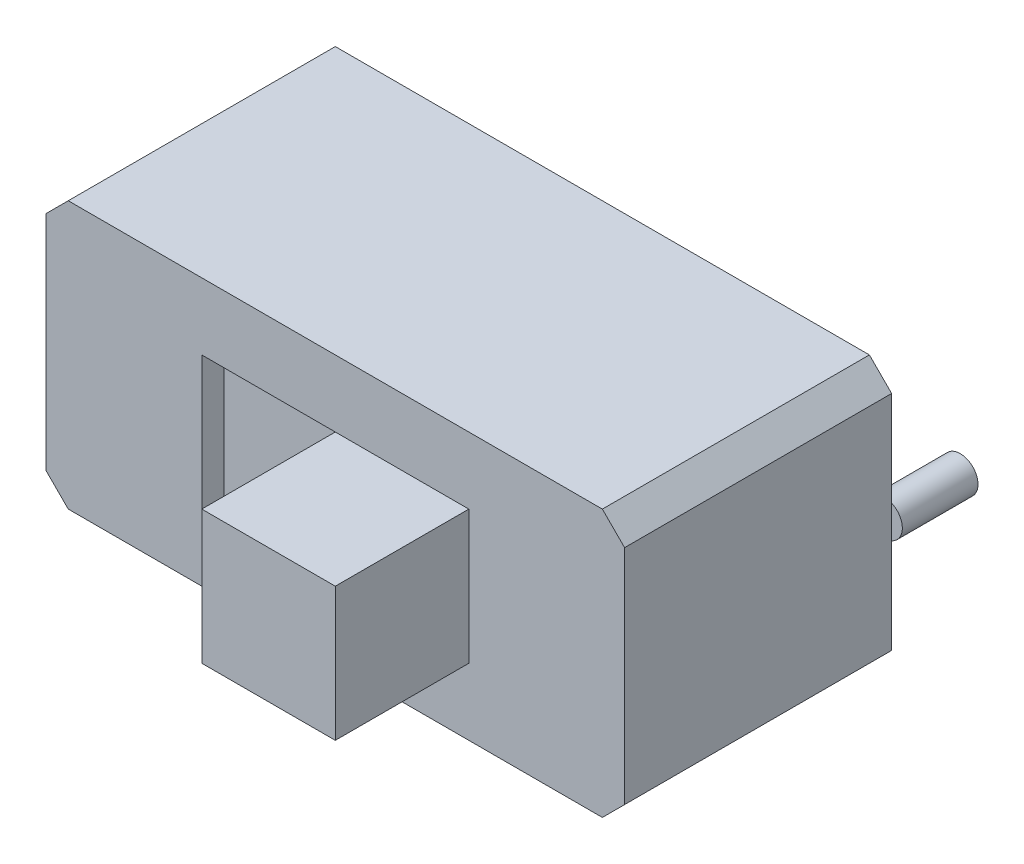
ISO-10303-21;
HEADER;
FILE_DESCRIPTION(('STEP AP214'),'2;1');
FILE_NAME('part.step','',(''),(''),'','','');
FILE_SCHEMA(('AUTOMOTIVE_DESIGN { 1 0 10303 214 1 1 1 1 }'));
ENDSEC;
DATA;
#1=APPLICATION_CONTEXT('core data for automotive mechanical design processes');
#2=APPLICATION_PROTOCOL_DEFINITION('international standard','automotive_design',2000,#1);
#3=PRODUCT_CONTEXT('',#1,'mechanical');
#4=PRODUCT('Part','Part','',(#3));
#5=PRODUCT_RELATED_PRODUCT_CATEGORY('part','',(#4));
#6=PRODUCT_DEFINITION_FORMATION('','',#4);
#7=PRODUCT_DEFINITION_CONTEXT('part definition',#1,'design');
#8=PRODUCT_DEFINITION('design','',#6,#7);
#9=PRODUCT_DEFINITION_SHAPE('','',#8);
#10=(LENGTH_UNIT() NAMED_UNIT(*) SI_UNIT(.MILLI.,.METRE.));
#11=(NAMED_UNIT(*) PLANE_ANGLE_UNIT() SI_UNIT($,.RADIAN.));
#12=(NAMED_UNIT(*) SI_UNIT($,.STERADIAN.) SOLID_ANGLE_UNIT());
#13=UNCERTAINTY_MEASURE_WITH_UNIT(LENGTH_MEASURE(1.E-05),#10,'distance_accuracy_value','');
#14=(GEOMETRIC_REPRESENTATION_CONTEXT(3) GLOBAL_UNCERTAINTY_ASSIGNED_CONTEXT((#13)) GLOBAL_UNIT_ASSIGNED_CONTEXT((#10,
#11,#12)) REPRESENTATION_CONTEXT('',''));
#15=CARTESIAN_POINT('',(0.,0.,0.));
#16=DIRECTION('',(0.,0.,1.));
#17=DIRECTION('',(1.,0.,0.));
#18=AXIS2_PLACEMENT_3D('',#15,#16,#17);
#19=CARTESIAN_POINT('',(0.,9.00000000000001,0.));
#20=DIRECTION('',(0.,0.,-1.));
#21=DIRECTION('',(-1.,0.,0.));
#22=AXIS2_PLACEMENT_3D('',#19,#20,#21);
#23=PLANE('',#22);
#24=CARTESIAN_POINT('',(3.17,0.,0.));
#25=DIRECTION('',(0.,0.,-1.));
#26=DIRECTION('',(1.,0.,0.));
#27=AXIS2_PLACEMENT_3D('',#24,#25,#26);
#28=CIRCLE('',#27,0.4);
#29=CARTESIAN_POINT('',(3.57,0.,0.));
#30=VERTEX_POINT('',#29);
#31=EDGE_CURVE('E270',#30,#30,#28,.T.);
#32=ORIENTED_EDGE('',*,*,#31,.F.);
#33=EDGE_LOOP('',(#32));
#34=FACE_BOUND('',#33,.T.);
#35=CARTESIAN_POINT('',(0.,0.,0.));
#36=DIRECTION('',(0.,0.,-1.));
#37=DIRECTION('',(-1.,0.,0.));
#38=AXIS2_PLACEMENT_3D('',#35,#36,#37);
#39=CIRCLE('',#38,0.4);
#40=CARTESIAN_POINT('',(-0.4,0.,0.));
#41=VERTEX_POINT('',#40);
#42=EDGE_CURVE('E264',#41,#41,#39,.T.);
#43=ORIENTED_EDGE('',*,*,#42,.F.);
#44=EDGE_LOOP('',(#43));
#45=FACE_BOUND('',#44,.T.);
#46=CARTESIAN_POINT('',(-3.17,0.,0.));
#47=DIRECTION('',(0.,0.,-1.));
#48=DIRECTION('',(-1.,0.,0.));
#49=AXIS2_PLACEMENT_3D('',#46,#47,#48);
#50=CIRCLE('',#49,0.4);
#51=CARTESIAN_POINT('',(-3.57,0.,0.));
#52=VERTEX_POINT('',#51);
#53=EDGE_CURVE('E276',#52,#52,#50,.T.);
#54=ORIENTED_EDGE('',*,*,#53,.F.);
#55=EDGE_LOOP('',(#54));
#56=FACE_BOUND('',#55,.T.);
#57=DIRECTION('',(0.,1.,0.));
#58=VECTOR('',#57,1.);
#59=CARTESIAN_POINT('',(6.5,-2.5,0.));
#60=LINE('',#59,#58);
#61=CARTESIAN_POINT('',(6.5,0.366606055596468,0.));
#62=VERTEX_POINT('',#61);
#63=CARTESIAN_POINT('',(6.5,2.5,0.));
#64=VERTEX_POINT('',#63);
#65=EDGE_CURVE('E163',#62,#64,#60,.T.);
#66=ORIENTED_EDGE('',*,*,#65,.F.);
#67=CARTESIAN_POINT('',(6.34,0.,0.));
#68=DIRECTION('',(0.,0.,-1.));
#69=DIRECTION('',(1.,0.,0.));
#70=AXIS2_PLACEMENT_3D('',#67,#68,#69);
#71=CIRCLE('',#70,0.4);
#72=CARTESIAN_POINT('',(6.5,-0.366606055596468,0.));
#73=VERTEX_POINT('',#72);
#74=EDGE_CURVE('E50',#73,#62,#71,.T.);
#75=ORIENTED_EDGE('',*,*,#74,.F.);
#76=CARTESIAN_POINT('',(6.5,-2.5,0.));
#77=VERTEX_POINT('',#76);
#78=EDGE_CURVE('E162',#77,#73,#60,.T.);
#79=ORIENTED_EDGE('',*,*,#78,.F.);
#80=DIRECTION('',(0.707106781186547,0.707106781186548,0.));
#81=VECTOR('',#80,1.);
#82=CARTESIAN_POINT('',(6.5,-2.5,0.));
#83=LINE('',#82,#81);
#84=CARTESIAN_POINT('',(6.,-3.,0.));
#85=VERTEX_POINT('',#84);
#86=EDGE_CURVE('E182',#85,#77,#83,.T.);
#87=ORIENTED_EDGE('',*,*,#86,.F.);
#88=DIRECTION('',(1.,0.,0.));
#89=VECTOR('',#88,1.);
#90=CARTESIAN_POINT('',(6.,-3.,0.));
#91=LINE('',#90,#89);
#92=CARTESIAN_POINT('',(-6.,-3.,0.));
#93=VERTEX_POINT('',#92);
#94=EDGE_CURVE('E185',#93,#85,#91,.T.);
#95=ORIENTED_EDGE('',*,*,#94,.F.);
#96=DIRECTION('',(0.707106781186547,-0.707106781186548,0.));
#97=VECTOR('',#96,1.);
#98=CARTESIAN_POINT('',(-6.5,-2.5,0.));
#99=LINE('',#98,#97);
#100=CARTESIAN_POINT('',(-6.5,-2.5,0.));
#101=VERTEX_POINT('',#100);
#102=EDGE_CURVE('E188',#101,#93,#99,.T.);
#103=ORIENTED_EDGE('',*,*,#102,.F.);
#104=DIRECTION('',(0.,-1.,0.));
#105=VECTOR('',#104,1.);
#106=CARTESIAN_POINT('',(-6.5,-2.5,0.));
#107=LINE('',#106,#105);
#108=CARTESIAN_POINT('',(-6.5,-0.366606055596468,0.));
#109=VERTEX_POINT('',#108);
#110=EDGE_CURVE('E196',#109,#101,#107,.T.);
#111=ORIENTED_EDGE('',*,*,#110,.F.);
#112=CARTESIAN_POINT('',(-6.34,0.,0.));
#113=DIRECTION('',(0.,0.,-1.));
#114=DIRECTION('',(-1.,0.,0.));
#115=AXIS2_PLACEMENT_3D('',#112,#113,#114);
#116=CIRCLE('',#115,0.4);
#117=CARTESIAN_POINT('',(-6.5,0.366606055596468,0.));
#118=VERTEX_POINT('',#117);
#119=EDGE_CURVE('E57',#118,#109,#116,.T.);
#120=ORIENTED_EDGE('',*,*,#119,.F.);
#121=CARTESIAN_POINT('',(-6.5,2.5,0.));
#122=VERTEX_POINT('',#121);
#123=EDGE_CURVE('E192',#122,#118,#107,.T.);
#124=ORIENTED_EDGE('',*,*,#123,.F.);
#125=DIRECTION('',(-0.707106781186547,-0.707106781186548,0.));
#126=VECTOR('',#125,1.);
#127=CARTESIAN_POINT('',(-6.5,2.5,0.));
#128=LINE('',#127,#126);
#129=CARTESIAN_POINT('',(-6.,3.,0.));
#130=VERTEX_POINT('',#129);
#131=EDGE_CURVE('E197',#130,#122,#128,.T.);
#132=ORIENTED_EDGE('',*,*,#131,.F.);
#133=DIRECTION('',(-1.,0.,0.));
#134=VECTOR('',#133,1.);
#135=CARTESIAN_POINT('',(6.,3.,0.));
#136=LINE('',#135,#134);
#137=CARTESIAN_POINT('',(6.,3.,0.));
#138=VERTEX_POINT('',#137);
#139=EDGE_CURVE('E199',#138,#130,#136,.T.);
#140=ORIENTED_EDGE('',*,*,#139,.F.);
#141=DIRECTION('',(-0.707106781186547,0.707106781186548,0.));
#142=VECTOR('',#141,1.);
#143=CARTESIAN_POINT('',(6.5,2.5,0.));
#144=LINE('',#143,#142);
#145=EDGE_CURVE('E201',#64,#138,#144,.T.);
#146=ORIENTED_EDGE('',*,*,#145,.F.);
#147=EDGE_LOOP('',(#66,#75,#79,#87,#95,#103,#111,#120,#124,#132,#140,#146));
#148=FACE_BOUND('',#147,.T.);
#149=ADVANCED_FACE('F36',(#34,#45,#56,#148),#23,.T.);
#150=CARTESIAN_POINT('',(0.,9.00000000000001,6.));
#151=DIRECTION('',(0.,0.,-1.));
#152=DIRECTION('',(-1.,0.,0.));
#153=AXIS2_PLACEMENT_3D('',#150,#151,#152);
#154=PLANE('',#153);
#155=DIRECTION('',(-0.707106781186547,0.707106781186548,0.));
#156=VECTOR('',#155,1.);
#157=CARTESIAN_POINT('',(6.5,2.5,6.));
#158=LINE('',#157,#156);
#159=CARTESIAN_POINT('',(6.5,2.5,6.));
#160=VERTEX_POINT('',#159);
#161=CARTESIAN_POINT('',(6.,3.,6.));
#162=VERTEX_POINT('',#161);
#163=EDGE_CURVE('E177',#160,#162,#158,.T.);
#164=ORIENTED_EDGE('',*,*,#163,.T.);
#165=DIRECTION('',(-1.,0.,0.));
#166=VECTOR('',#165,1.);
#167=CARTESIAN_POINT('',(6.,3.,6.));
#168=LINE('',#167,#166);
#169=CARTESIAN_POINT('',(-6.,3.,6.));
#170=VERTEX_POINT('',#169);
#171=EDGE_CURVE('E179',#162,#170,#168,.T.);
#172=ORIENTED_EDGE('',*,*,#171,.T.);
#173=DIRECTION('',(-0.707106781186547,-0.707106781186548,0.));
#174=VECTOR('',#173,1.);
#175=CARTESIAN_POINT('',(-6.5,2.5,6.));
#176=LINE('',#175,#174);
#177=CARTESIAN_POINT('',(-6.5,2.5,6.));
#178=VERTEX_POINT('',#177);
#179=EDGE_CURVE('E329',#170,#178,#176,.T.);
#180=ORIENTED_EDGE('',*,*,#179,.T.);
#181=DIRECTION('',(0.,-1.,0.));
#182=VECTOR('',#181,1.);
#183=CARTESIAN_POINT('',(-6.5,-2.5,6.));
#184=LINE('',#183,#182);
#185=CARTESIAN_POINT('',(-6.5,-2.5,6.));
#186=VERTEX_POINT('',#185);
#187=EDGE_CURVE('E303',#178,#186,#184,.T.);
#188=ORIENTED_EDGE('',*,*,#187,.T.);
#189=DIRECTION('',(0.707106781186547,-0.707106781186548,0.));
#190=VECTOR('',#189,1.);
#191=CARTESIAN_POINT('',(-6.5,-2.5,6.));
#192=LINE('',#191,#190);
#193=CARTESIAN_POINT('',(-6.,-3.,6.));
#194=VERTEX_POINT('',#193);
#195=EDGE_CURVE('E326',#186,#194,#192,.T.);
#196=ORIENTED_EDGE('',*,*,#195,.T.);
#197=DIRECTION('',(1.,0.,0.));
#198=VECTOR('',#197,1.);
#199=CARTESIAN_POINT('',(6.,-3.,6.));
#200=LINE('',#199,#198);
#201=CARTESIAN_POINT('',(6.,-3.,6.));
#202=VERTEX_POINT('',#201);
#203=EDGE_CURVE('E324',#194,#202,#200,.T.);
#204=ORIENTED_EDGE('',*,*,#203,.T.);
#205=DIRECTION('',(0.707106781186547,0.707106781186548,0.));
#206=VECTOR('',#205,1.);
#207=CARTESIAN_POINT('',(6.5,-2.5,6.));
#208=LINE('',#207,#206);
#209=CARTESIAN_POINT('',(6.5,-2.5,6.));
#210=VERTEX_POINT('',#209);
#211=EDGE_CURVE('E322',#202,#210,#208,.T.);
#212=ORIENTED_EDGE('',*,*,#211,.T.);
#213=DIRECTION('',(0.,1.,0.));
#214=VECTOR('',#213,1.);
#215=CARTESIAN_POINT('',(6.5,-2.5,6.));
#216=LINE('',#215,#214);
#217=EDGE_CURVE('E320',#210,#160,#216,.T.);
#218=ORIENTED_EDGE('',*,*,#217,.T.);
#219=EDGE_LOOP('',(#164,#172,#180,#188,#196,#204,#212,#218));
#220=FACE_BOUND('',#219,.T.);
#221=DIRECTION('',(0.,-1.,0.));
#222=VECTOR('',#221,1.);
#223=CARTESIAN_POINT('',(-3.,-1.5,6.));
#224=LINE('',#223,#222);
#225=CARTESIAN_POINT('',(-3.,1.5,6.));
#226=VERTEX_POINT('',#225);
#227=CARTESIAN_POINT('',(-3.,-1.5,6.));
#228=VERTEX_POINT('',#227);
#229=EDGE_CURVE('E257',#226,#228,#224,.T.);
#230=ORIENTED_EDGE('',*,*,#229,.F.);
#231=DIRECTION('',(-1.,0.,0.));
#232=VECTOR('',#231,1.);
#233=CARTESIAN_POINT('',(0.,1.5,6.));
#234=LINE('',#233,#232);
#235=CARTESIAN_POINT('',(0.,1.5,6.));
#236=VERTEX_POINT('',#235);
#237=EDGE_CURVE('E260',#236,#226,#234,.T.);
#238=ORIENTED_EDGE('',*,*,#237,.F.);
#239=DIRECTION('',(-1.,0.,0.));
#240=VECTOR('',#239,1.);
#241=CARTESIAN_POINT('',(0.,1.5,6.));
#242=LINE('',#241,#240);
#243=CARTESIAN_POINT('',(3.,1.5,6.));
#244=VERTEX_POINT('',#243);
#245=EDGE_CURVE('E225',#244,#236,#242,.T.);
#246=ORIENTED_EDGE('',*,*,#245,.F.);
#247=DIRECTION('',(0.,1.,0.));
#248=VECTOR('',#247,1.);
#249=CARTESIAN_POINT('',(3.,1.5,6.));
#250=LINE('',#249,#248);
#251=CARTESIAN_POINT('',(3.,-1.5,6.));
#252=VERTEX_POINT('',#251);
#253=EDGE_CURVE('E228',#252,#244,#250,.T.);
#254=ORIENTED_EDGE('',*,*,#253,.F.);
#255=DIRECTION('',(1.,0.,0.));
#256=VECTOR('',#255,1.);
#257=CARTESIAN_POINT('',(0.,-1.5,6.));
#258=LINE('',#257,#256);
#259=CARTESIAN_POINT('',(0.,-1.5,6.));
#260=VERTEX_POINT('',#259);
#261=EDGE_CURVE('E231',#260,#252,#258,.T.);
#262=ORIENTED_EDGE('',*,*,#261,.F.);
#263=DIRECTION('',(1.,0.,0.));
#264=VECTOR('',#263,1.);
#265=CARTESIAN_POINT('',(0.,-1.5,6.));
#266=LINE('',#265,#264);
#267=EDGE_CURVE('E255',#228,#260,#266,.T.);
#268=ORIENTED_EDGE('',*,*,#267,.F.);
#269=EDGE_LOOP('',(#230,#238,#246,#254,#262,#268));
#270=FACE_BOUND('',#269,.T.);
#271=ADVANCED_FACE('F333',(#220,#270),#154,.F.);
#272=CARTESIAN_POINT('',(6.5,2.5,6.));
#273=DIRECTION('',(-0.707106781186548,-0.707106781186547,0.));
#274=DIRECTION('',(0.707106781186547,-0.707106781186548,0.));
#275=AXIS2_PLACEMENT_3D('',#272,#273,#274);
#276=PLANE('',#275);
#277=ORIENTED_EDGE('',*,*,#145,.T.);
#278=DIRECTION('',(0.,0.,-1.));
#279=VECTOR('',#278,1.);
#280=CARTESIAN_POINT('',(6.,3.,6.));
#281=LINE('',#280,#279);
#282=EDGE_CURVE('E11',#162,#138,#281,.T.);
#283=ORIENTED_EDGE('',*,*,#282,.F.);
#284=ORIENTED_EDGE('',*,*,#163,.F.);
#285=DIRECTION('',(0.,0.,-1.));
#286=VECTOR('',#285,1.);
#287=CARTESIAN_POINT('',(6.5,2.5,6.));
#288=LINE('',#287,#286);
#289=EDGE_CURVE('E318',#160,#64,#288,.T.);
#290=ORIENTED_EDGE('',*,*,#289,.T.);
#291=EDGE_LOOP('',(#277,#283,#284,#290));
#292=FACE_BOUND('',#291,.T.);
#293=ADVANCED_FACE('F38',(#292),#276,.F.);
#294=CARTESIAN_POINT('',(6.,3.,6.));
#295=DIRECTION('',(0.,-1.,0.));
#296=DIRECTION('',(0.,0.,-1.));
#297=AXIS2_PLACEMENT_3D('',#294,#295,#296);
#298=PLANE('',#297);
#299=ORIENTED_EDGE('',*,*,#139,.T.);
#300=DIRECTION('',(0.,0.,-1.));
#301=VECTOR('',#300,1.);
#302=CARTESIAN_POINT('',(-6.,3.,6.));
#303=LINE('',#302,#301);
#304=EDGE_CURVE('E44',#170,#130,#303,.T.);
#305=ORIENTED_EDGE('',*,*,#304,.F.);
#306=ORIENTED_EDGE('',*,*,#171,.F.);
#307=ORIENTED_EDGE('',*,*,#282,.T.);
#308=EDGE_LOOP('',(#299,#305,#306,#307));
#309=FACE_BOUND('',#308,.T.);
#310=ADVANCED_FACE('F338',(#309),#298,.F.);
#311=CARTESIAN_POINT('',(-6.5,2.5,6.));
#312=DIRECTION('',(0.707106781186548,-0.707106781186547,0.));
#313=DIRECTION('',(0.707106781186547,0.707106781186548,0.));
#314=AXIS2_PLACEMENT_3D('',#311,#312,#313);
#315=PLANE('',#314);
#316=ORIENTED_EDGE('',*,*,#131,.T.);
#317=DIRECTION('',(0.,0.,-1.));
#318=VECTOR('',#317,1.);
#319=CARTESIAN_POINT('',(-6.5,2.5,6.));
#320=LINE('',#319,#318);
#321=EDGE_CURVE('E301',#178,#122,#320,.T.);
#322=ORIENTED_EDGE('',*,*,#321,.F.);
#323=ORIENTED_EDGE('',*,*,#179,.F.);
#324=ORIENTED_EDGE('',*,*,#304,.T.);
#325=EDGE_LOOP('',(#316,#322,#323,#324));
#326=FACE_BOUND('',#325,.T.);
#327=ADVANCED_FACE('F339',(#326),#315,.F.);
#328=CARTESIAN_POINT('',(-6.5,-2.5,6.));
#329=DIRECTION('',(1.,0.,0.));
#330=DIRECTION('',(0.,0.,-1.));
#331=AXIS2_PLACEMENT_3D('',#328,#329,#330);
#332=PLANE('',#331);
#333=ORIENTED_EDGE('',*,*,#123,.T.);
#334=EDGE_CURVE('E195',#118,#109,#107,.T.);
#335=ORIENTED_EDGE('',*,*,#334,.T.);
#336=ORIENTED_EDGE('',*,*,#110,.T.);
#337=DIRECTION('',(0.,0.,-1.));
#338=VECTOR('',#337,1.);
#339=CARTESIAN_POINT('',(-6.5,-2.5,6.));
#340=LINE('',#339,#338);
#341=EDGE_CURVE('E306',#186,#101,#340,.T.);
#342=ORIENTED_EDGE('',*,*,#341,.F.);
#343=ORIENTED_EDGE('',*,*,#187,.F.);
#344=ORIENTED_EDGE('',*,*,#321,.T.);
#345=EDGE_LOOP('',(#333,#335,#336,#342,#343,#344));
#346=FACE_BOUND('',#345,.T.);
#347=ADVANCED_FACE('F298',(#346),#332,.F.);
#348=CARTESIAN_POINT('',(-6.5,-2.5,6.));
#349=DIRECTION('',(0.707106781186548,0.707106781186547,0.));
#350=DIRECTION('',(-0.707106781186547,0.707106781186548,0.));
#351=AXIS2_PLACEMENT_3D('',#348,#349,#350);
#352=PLANE('',#351);
#353=ORIENTED_EDGE('',*,*,#102,.T.);
#354=DIRECTION('',(0.,0.,-1.));
#355=VECTOR('',#354,1.);
#356=CARTESIAN_POINT('',(-6.,-3.,6.));
#357=LINE('',#356,#355);
#358=EDGE_CURVE('E310',#194,#93,#357,.T.);
#359=ORIENTED_EDGE('',*,*,#358,.F.);
#360=ORIENTED_EDGE('',*,*,#195,.F.);
#361=ORIENTED_EDGE('',*,*,#341,.T.);
#362=EDGE_LOOP('',(#353,#359,#360,#361));
#363=FACE_BOUND('',#362,.T.);
#364=ADVANCED_FACE('F346',(#363),#352,.F.);
#365=CARTESIAN_POINT('',(6.,-3.,6.));
#366=DIRECTION('',(0.,1.,0.));
#367=DIRECTION('',(0.,0.,1.));
#368=AXIS2_PLACEMENT_3D('',#365,#366,#367);
#369=PLANE('',#368);
#370=ORIENTED_EDGE('',*,*,#94,.T.);
#371=DIRECTION('',(0.,0.,-1.));
#372=VECTOR('',#371,1.);
#373=CARTESIAN_POINT('',(6.,-3.,6.));
#374=LINE('',#373,#372);
#375=EDGE_CURVE('E315',#202,#85,#374,.T.);
#376=ORIENTED_EDGE('',*,*,#375,.F.);
#377=ORIENTED_EDGE('',*,*,#203,.F.);
#378=ORIENTED_EDGE('',*,*,#358,.T.);
#379=EDGE_LOOP('',(#370,#376,#377,#378));
#380=FACE_BOUND('',#379,.T.);
#381=ADVANCED_FACE('F366',(#380),#369,.F.);
#382=CARTESIAN_POINT('',(6.5,-2.5,6.));
#383=DIRECTION('',(-0.707106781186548,0.707106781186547,0.));
#384=DIRECTION('',(-0.707106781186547,-0.707106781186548,0.));
#385=AXIS2_PLACEMENT_3D('',#382,#383,#384);
#386=PLANE('',#385);
#387=ORIENTED_EDGE('',*,*,#86,.T.);
#388=DIRECTION('',(0.,0.,-1.));
#389=VECTOR('',#388,1.);
#390=CARTESIAN_POINT('',(6.5,-2.5,6.));
#391=LINE('',#390,#389);
#392=EDGE_CURVE('E176',#210,#77,#391,.T.);
#393=ORIENTED_EDGE('',*,*,#392,.F.);
#394=ORIENTED_EDGE('',*,*,#211,.F.);
#395=ORIENTED_EDGE('',*,*,#375,.T.);
#396=EDGE_LOOP('',(#387,#393,#394,#395));
#397=FACE_BOUND('',#396,.T.);
#398=ADVANCED_FACE('F363',(#397),#386,.F.);
#399=CARTESIAN_POINT('',(6.5,-2.5,6.));
#400=DIRECTION('',(-1.,0.,0.));
#401=DIRECTION('',(0.,0.,1.));
#402=AXIS2_PLACEMENT_3D('',#399,#400,#401);
#403=PLANE('',#402);
#404=ORIENTED_EDGE('',*,*,#78,.T.);
#405=EDGE_CURVE('E156',#73,#62,#60,.T.);
#406=ORIENTED_EDGE('',*,*,#405,.T.);
#407=ORIENTED_EDGE('',*,*,#65,.T.);
#408=ORIENTED_EDGE('',*,*,#289,.F.);
#409=ORIENTED_EDGE('',*,*,#217,.F.);
#410=ORIENTED_EDGE('',*,*,#392,.T.);
#411=EDGE_LOOP('',(#404,#406,#407,#408,#409,#410));
#412=FACE_BOUND('',#411,.T.);
#413=ADVANCED_FACE('F173',(#412),#403,.F.);
#414=CARTESIAN_POINT('',(0.,-1.5,9.));
#415=DIRECTION('',(1.,0.,0.));
#416=DIRECTION('',(0.,0.,-1.));
#417=AXIS2_PLACEMENT_3D('',#414,#415,#416);
#418=PLANE('',#417);
#419=DIRECTION('',(0.,0.,-1.));
#420=VECTOR('',#419,1.);
#421=CARTESIAN_POINT('',(0.,1.5,9.));
#422=LINE('',#421,#420);
#423=CARTESIAN_POINT('',(0.,1.5,9.));
#424=VERTEX_POINT('',#423);
#425=EDGE_CURVE('E213',#424,#236,#422,.T.);
#426=ORIENTED_EDGE('',*,*,#425,.T.);
#427=DIRECTION('',(0.,0.,1.));
#428=VECTOR('',#427,1.);
#429=CARTESIAN_POINT('',(0.,1.5,5.5));
#430=LINE('',#429,#428);
#431=CARTESIAN_POINT('',(0.,1.5,5.5));
#432=VERTEX_POINT('',#431);
#433=EDGE_CURVE('E234',#432,#236,#430,.T.);
#434=ORIENTED_EDGE('',*,*,#433,.F.);
#435=DIRECTION('',(0.,1.,0.));
#436=VECTOR('',#435,1.);
#437=CARTESIAN_POINT('',(0.,-1.5,5.5));
#438=LINE('',#437,#436);
#439=CARTESIAN_POINT('',(0.,-1.5,5.5));
#440=VERTEX_POINT('',#439);
#441=EDGE_CURVE('E238',#440,#432,#438,.T.);
#442=ORIENTED_EDGE('',*,*,#441,.F.);
#443=DIRECTION('',(0.,0.,1.));
#444=VECTOR('',#443,1.);
#445=CARTESIAN_POINT('',(0.,-1.5,5.5));
#446=LINE('',#445,#444);
#447=EDGE_CURVE('E240',#440,#260,#446,.T.);
#448=ORIENTED_EDGE('',*,*,#447,.T.);
#449=DIRECTION('',(0.,0.,-1.));
#450=VECTOR('',#449,1.);
#451=CARTESIAN_POINT('',(0.,-1.5,9.));
#452=LINE('',#451,#450);
#453=CARTESIAN_POINT('',(0.,-1.5,9.));
#454=VERTEX_POINT('',#453);
#455=EDGE_CURVE('E204',#454,#260,#452,.T.);
#456=ORIENTED_EDGE('',*,*,#455,.F.);
#457=DIRECTION('',(0.,-1.,0.));
#458=VECTOR('',#457,1.);
#459=CARTESIAN_POINT('',(0.,-1.5,9.));
#460=LINE('',#459,#458);
#461=EDGE_CURVE('E222',#424,#454,#460,.T.);
#462=ORIENTED_EDGE('',*,*,#461,.F.);
#463=EDGE_LOOP('',(#426,#434,#442,#448,#456,#462));
#464=FACE_BOUND('',#463,.T.);
#465=ADVANCED_FACE('F358',(#464),#418,.F.);
#466=CARTESIAN_POINT('',(0.,-1.5,9.));
#467=DIRECTION('',(0.,1.,0.));
#468=DIRECTION('',(0.,0.,1.));
#469=AXIS2_PLACEMENT_3D('',#466,#467,#468);
#470=PLANE('',#469);
#471=ORIENTED_EDGE('',*,*,#261,.T.);
#472=DIRECTION('',(0.,0.,-1.));
#473=VECTOR('',#472,1.);
#474=CARTESIAN_POINT('',(3.,-1.5,9.));
#475=LINE('',#474,#473);
#476=CARTESIAN_POINT('',(3.,-1.5,9.));
#477=VERTEX_POINT('',#476);
#478=EDGE_CURVE('E207',#477,#252,#475,.T.);
#479=ORIENTED_EDGE('',*,*,#478,.F.);
#480=DIRECTION('',(1.,0.,0.));
#481=VECTOR('',#480,1.);
#482=CARTESIAN_POINT('',(0.,-1.5,9.));
#483=LINE('',#482,#481);
#484=EDGE_CURVE('E220',#454,#477,#483,.T.);
#485=ORIENTED_EDGE('',*,*,#484,.F.);
#486=ORIENTED_EDGE('',*,*,#455,.T.);
#487=EDGE_LOOP('',(#471,#479,#485,#486));
#488=FACE_BOUND('',#487,.T.);
#489=ADVANCED_FACE('F423',(#488),#470,.F.);
#490=CARTESIAN_POINT('',(3.,1.5,9.));
#491=DIRECTION('',(-1.,0.,0.));
#492=DIRECTION('',(0.,-1.,0.));
#493=AXIS2_PLACEMENT_3D('',#490,#491,#492);
#494=PLANE('',#493);
#495=ORIENTED_EDGE('',*,*,#253,.T.);
#496=DIRECTION('',(0.,0.,-1.));
#497=VECTOR('',#496,1.);
#498=CARTESIAN_POINT('',(3.,1.5,9.));
#499=LINE('',#498,#497);
#500=CARTESIAN_POINT('',(3.,1.5,9.));
#501=VERTEX_POINT('',#500);
#502=EDGE_CURVE('E210',#501,#244,#499,.T.);
#503=ORIENTED_EDGE('',*,*,#502,.F.);
#504=DIRECTION('',(0.,1.,0.));
#505=VECTOR('',#504,1.);
#506=CARTESIAN_POINT('',(3.,1.5,9.));
#507=LINE('',#506,#505);
#508=EDGE_CURVE('E218',#477,#501,#507,.T.);
#509=ORIENTED_EDGE('',*,*,#508,.F.);
#510=ORIENTED_EDGE('',*,*,#478,.T.);
#511=EDGE_LOOP('',(#495,#503,#509,#510));
#512=FACE_BOUND('',#511,.T.);
#513=ADVANCED_FACE('F417',(#512),#494,.F.);
#514=CARTESIAN_POINT('',(0.,1.5,9.));
#515=DIRECTION('',(0.,-1.,0.));
#516=DIRECTION('',(0.,0.,-1.));
#517=AXIS2_PLACEMENT_3D('',#514,#515,#516);
#518=PLANE('',#517);
#519=ORIENTED_EDGE('',*,*,#245,.T.);
#520=ORIENTED_EDGE('',*,*,#425,.F.);
#521=DIRECTION('',(-1.,0.,0.));
#522=VECTOR('',#521,1.);
#523=CARTESIAN_POINT('',(0.,1.5,9.));
#524=LINE('',#523,#522);
#525=EDGE_CURVE('E216',#501,#424,#524,.T.);
#526=ORIENTED_EDGE('',*,*,#525,.F.);
#527=ORIENTED_EDGE('',*,*,#502,.T.);
#528=EDGE_LOOP('',(#519,#520,#526,#527));
#529=FACE_BOUND('',#528,.T.);
#530=ADVANCED_FACE('F422',(#529),#518,.F.);
#531=CARTESIAN_POINT('',(0.,1.5,9.));
#532=DIRECTION('',(0.,0.,-1.));
#533=DIRECTION('',(-1.,0.,0.));
#534=AXIS2_PLACEMENT_3D('',#531,#532,#533);
#535=PLANE('',#534);
#536=ORIENTED_EDGE('',*,*,#461,.T.);
#537=ORIENTED_EDGE('',*,*,#484,.T.);
#538=ORIENTED_EDGE('',*,*,#508,.T.);
#539=ORIENTED_EDGE('',*,*,#525,.T.);
#540=EDGE_LOOP('',(#536,#537,#538,#539));
#541=FACE_BOUND('',#540,.T.);
#542=ADVANCED_FACE('F433',(#541),#535,.F.);
#543=CARTESIAN_POINT('',(0.,1.5,5.5));
#544=DIRECTION('',(0.,1.,0.));
#545=DIRECTION('',(-1.,0.,0.));
#546=AXIS2_PLACEMENT_3D('',#543,#544,#545);
#547=PLANE('',#546);
#548=ORIENTED_EDGE('',*,*,#237,.T.);
#549=DIRECTION('',(0.,0.,1.));
#550=VECTOR('',#549,1.);
#551=CARTESIAN_POINT('',(-3.,1.5,5.5));
#552=LINE('',#551,#550);
#553=CARTESIAN_POINT('',(-3.,1.5,5.5));
#554=VERTEX_POINT('',#553);
#555=EDGE_CURVE('E235',#554,#226,#552,.T.);
#556=ORIENTED_EDGE('',*,*,#555,.F.);
#557=DIRECTION('',(-1.,0.,0.));
#558=VECTOR('',#557,1.);
#559=CARTESIAN_POINT('',(0.,1.5,5.5));
#560=LINE('',#559,#558);
#561=EDGE_CURVE('E252',#432,#554,#560,.T.);
#562=ORIENTED_EDGE('',*,*,#561,.F.);
#563=ORIENTED_EDGE('',*,*,#433,.T.);
#564=EDGE_LOOP('',(#548,#556,#562,#563));
#565=FACE_BOUND('',#564,.T.);
#566=ADVANCED_FACE('F437',(#565),#547,.F.);
#567=CARTESIAN_POINT('',(0.,-1.5,5.5));
#568=DIRECTION('',(0.,-1.,0.));
#569=DIRECTION('',(1.,0.,0.));
#570=AXIS2_PLACEMENT_3D('',#567,#568,#569);
#571=PLANE('',#570);
#572=ORIENTED_EDGE('',*,*,#267,.T.);
#573=ORIENTED_EDGE('',*,*,#447,.F.);
#574=DIRECTION('',(1.,0.,0.));
#575=VECTOR('',#574,1.);
#576=CARTESIAN_POINT('',(0.,-1.5,5.5));
#577=LINE('',#576,#575);
#578=CARTESIAN_POINT('',(-3.,-1.5,5.5));
#579=VERTEX_POINT('',#578);
#580=EDGE_CURVE('E246',#579,#440,#577,.T.);
#581=ORIENTED_EDGE('',*,*,#580,.F.);
#582=DIRECTION('',(0.,0.,1.));
#583=VECTOR('',#582,1.);
#584=CARTESIAN_POINT('',(-3.,-1.5,5.5));
#585=LINE('',#584,#583);
#586=EDGE_CURVE('E237',#579,#228,#585,.T.);
#587=ORIENTED_EDGE('',*,*,#586,.T.);
#588=EDGE_LOOP('',(#572,#573,#581,#587));
#589=FACE_BOUND('',#588,.T.);
#590=ADVANCED_FACE('F474',(#589),#571,.F.);
#591=CARTESIAN_POINT('',(-3.,-1.5,5.5));
#592=DIRECTION('',(-1.,0.,0.));
#593=DIRECTION('',(0.,0.,1.));
#594=AXIS2_PLACEMENT_3D('',#591,#592,#593);
#595=PLANE('',#594);
#596=ORIENTED_EDGE('',*,*,#229,.T.);
#597=ORIENTED_EDGE('',*,*,#586,.F.);
#598=DIRECTION('',(0.,-1.,0.));
#599=VECTOR('',#598,1.);
#600=CARTESIAN_POINT('',(-3.,-1.5,5.5));
#601=LINE('',#600,#599);
#602=EDGE_CURVE('E249',#554,#579,#601,.T.);
#603=ORIENTED_EDGE('',*,*,#602,.F.);
#604=ORIENTED_EDGE('',*,*,#555,.T.);
#605=EDGE_LOOP('',(#596,#597,#603,#604));
#606=FACE_BOUND('',#605,.T.);
#607=ADVANCED_FACE('F484',(#606),#595,.F.);
#608=CARTESIAN_POINT('',(0.,1.5,5.5));
#609=DIRECTION('',(0.,0.,-1.));
#610=DIRECTION('',(-1.,0.,0.));
#611=AXIS2_PLACEMENT_3D('',#608,#609,#610);
#612=PLANE('',#611);
#613=ORIENTED_EDGE('',*,*,#561,.T.);
#614=ORIENTED_EDGE('',*,*,#602,.T.);
#615=ORIENTED_EDGE('',*,*,#580,.T.);
#616=ORIENTED_EDGE('',*,*,#441,.T.);
#617=EDGE_LOOP('',(#613,#614,#615,#616));
#618=FACE_BOUND('',#617,.T.);
#619=ADVANCED_FACE('F494',(#618),#612,.F.);
#620=CARTESIAN_POINT('',(0.,0.,-1.7));
#621=DIRECTION('',(0.,0.,1.));
#622=DIRECTION('',(1.,0.,0.));
#623=AXIS2_PLACEMENT_3D('',#620,#621,#622);
#624=CYLINDRICAL_SURFACE('',#623,0.4);
#625=CARTESIAN_POINT('',(0.,0.,-1.7));
#626=DIRECTION('',(0.,0.,-1.));
#627=DIRECTION('',(-1.,0.,0.));
#628=AXIS2_PLACEMENT_3D('',#625,#626,#627);
#629=CIRCLE('',#628,0.4);
#630=CARTESIAN_POINT('',(-0.4,0.,-1.7));
#631=VERTEX_POINT('',#630);
#632=EDGE_CURVE('E263',#631,#631,#629,.T.);
#633=ORIENTED_EDGE('',*,*,#632,.F.);
#634=EDGE_LOOP('',(#633));
#635=FACE_BOUND('',#634,.T.);
#636=ORIENTED_EDGE('',*,*,#42,.T.);
#637=EDGE_LOOP('',(#636));
#638=FACE_BOUND('',#637,.T.);
#639=ADVANCED_FACE('F504',(#635,#638),#624,.T.);
#640=CARTESIAN_POINT('',(0.,0.,-1.7));
#641=DIRECTION('',(0.,0.,-1.));
#642=DIRECTION('',(-1.,0.,0.));
#643=AXIS2_PLACEMENT_3D('',#640,#641,#642);
#644=PLANE('',#643);
#645=ORIENTED_EDGE('',*,*,#632,.T.);
#646=EDGE_LOOP('',(#645));
#647=FACE_BOUND('',#646,.T.);
#648=ADVANCED_FACE('F529',(#647),#644,.T.);
#649=CARTESIAN_POINT('',(3.17,0.,-1.7));
#650=DIRECTION('',(0.,0.,1.));
#651=DIRECTION('',(1.,0.,0.));
#652=AXIS2_PLACEMENT_3D('',#649,#650,#651);
#653=CYLINDRICAL_SURFACE('',#652,0.4);
#654=CARTESIAN_POINT('',(3.17,0.,-1.7));
#655=DIRECTION('',(0.,0.,-1.));
#656=DIRECTION('',(1.,0.,0.));
#657=AXIS2_PLACEMENT_3D('',#654,#655,#656);
#658=CIRCLE('',#657,0.4);
#659=CARTESIAN_POINT('',(3.57,0.,-1.7));
#660=VERTEX_POINT('',#659);
#661=EDGE_CURVE('E267',#660,#660,#658,.T.);
#662=ORIENTED_EDGE('',*,*,#661,.F.);
#663=EDGE_LOOP('',(#662));
#664=FACE_BOUND('',#663,.T.);
#665=ORIENTED_EDGE('',*,*,#31,.T.);
#666=EDGE_LOOP('',(#665));
#667=FACE_BOUND('',#666,.T.);
#668=ADVANCED_FACE('F539',(#664,#667),#653,.T.);
#669=CARTESIAN_POINT('',(3.17,0.,-1.7));
#670=DIRECTION('',(0.,0.,1.));
#671=DIRECTION('',(1.,0.,0.));
#672=AXIS2_PLACEMENT_3D('',#669,#670,#671);
#673=PLANE('',#672);
#674=ORIENTED_EDGE('',*,*,#661,.T.);
#675=EDGE_LOOP('',(#674));
#676=FACE_BOUND('',#675,.T.);
#677=ADVANCED_FACE('F549',(#676),#673,.F.);
#678=CARTESIAN_POINT('',(-3.17,0.,-1.7));
#679=DIRECTION('',(0.,0.,1.));
#680=DIRECTION('',(1.,0.,0.));
#681=AXIS2_PLACEMENT_3D('',#678,#679,#680);
#682=CYLINDRICAL_SURFACE('',#681,0.4);
#683=CARTESIAN_POINT('',(-3.17,0.,-1.7));
#684=DIRECTION('',(0.,0.,-1.));
#685=DIRECTION('',(-1.,0.,0.));
#686=AXIS2_PLACEMENT_3D('',#683,#684,#685);
#687=CIRCLE('',#686,0.4);
#688=CARTESIAN_POINT('',(-3.57,0.,-1.7));
#689=VERTEX_POINT('',#688);
#690=EDGE_CURVE('E273',#689,#689,#687,.T.);
#691=ORIENTED_EDGE('',*,*,#690,.F.);
#692=EDGE_LOOP('',(#691));
#693=FACE_BOUND('',#692,.T.);
#694=ORIENTED_EDGE('',*,*,#53,.T.);
#695=EDGE_LOOP('',(#694));
#696=FACE_BOUND('',#695,.T.);
#697=ADVANCED_FACE('F559',(#693,#696),#682,.T.);
#698=CARTESIAN_POINT('',(-3.17,0.,-1.7));
#699=DIRECTION('',(0.,0.,-1.));
#700=DIRECTION('',(-1.,0.,0.));
#701=AXIS2_PLACEMENT_3D('',#698,#699,#700);
#702=PLANE('',#701);
#703=ORIENTED_EDGE('',*,*,#690,.T.);
#704=EDGE_LOOP('',(#703));
#705=FACE_BOUND('',#704,.T.);
#706=ADVANCED_FACE('F569',(#705),#702,.T.);
#707=CARTESIAN_POINT('',(-6.34,0.,0.));
#708=DIRECTION('',(0.,0.,-1.));
#709=DIRECTION('',(-1.,0.,0.));
#710=AXIS2_PLACEMENT_3D('',#707,#708,#709);
#711=PLANE('',#710);
#712=EDGE_CURVE('E283',#109,#118,#116,.T.);
#713=ORIENTED_EDGE('',*,*,#712,.F.);
#714=ORIENTED_EDGE('',*,*,#334,.F.);
#715=EDGE_LOOP('',(#713,#714));
#716=FACE_BOUND('',#715,.T.);
#717=ADVANCED_FACE('F579',(#716),#711,.F.);
#718=CARTESIAN_POINT('',(-6.34,0.,-1.7));
#719=DIRECTION('',(0.,0.,1.));
#720=DIRECTION('',(1.,0.,0.));
#721=AXIS2_PLACEMENT_3D('',#718,#719,#720);
#722=CYLINDRICAL_SURFACE('',#721,0.4);
#723=CARTESIAN_POINT('',(-6.34,0.,-1.7));
#724=DIRECTION('',(0.,0.,-1.));
#725=DIRECTION('',(-1.,0.,0.));
#726=AXIS2_PLACEMENT_3D('',#723,#724,#725);
#727=CIRCLE('',#726,0.4);
#728=CARTESIAN_POINT('',(-6.74,0.,-1.7));
#729=VERTEX_POINT('',#728);
#730=EDGE_CURVE('E279',#729,#729,#727,.T.);
#731=ORIENTED_EDGE('',*,*,#730,.F.);
#732=EDGE_LOOP('',(#731));
#733=FACE_BOUND('',#732,.T.);
#734=ORIENTED_EDGE('',*,*,#119,.T.);
#735=ORIENTED_EDGE('',*,*,#712,.T.);
#736=EDGE_LOOP('',(#734,#735));
#737=FACE_BOUND('',#736,.T.);
#738=ADVANCED_FACE('F289',(#733,#737),#722,.T.);
#739=CARTESIAN_POINT('',(-6.34,0.,-1.7));
#740=DIRECTION('',(0.,0.,-1.));
#741=DIRECTION('',(-1.,0.,0.));
#742=AXIS2_PLACEMENT_3D('',#739,#740,#741);
#743=PLANE('',#742);
#744=ORIENTED_EDGE('',*,*,#730,.T.);
#745=EDGE_LOOP('',(#744));
#746=FACE_BOUND('',#745,.T.);
#747=ADVANCED_FACE('F597',(#746),#743,.T.);
#748=CARTESIAN_POINT('',(6.34,0.,0.));
#749=DIRECTION('',(0.,0.,1.));
#750=DIRECTION('',(1.,0.,0.));
#751=AXIS2_PLACEMENT_3D('',#748,#749,#750);
#752=PLANE('',#751);
#753=ORIENTED_EDGE('',*,*,#405,.F.);
#754=EDGE_CURVE('E158',#62,#73,#71,.T.);
#755=ORIENTED_EDGE('',*,*,#754,.F.);
#756=EDGE_LOOP('',(#753,#755));
#757=FACE_BOUND('',#756,.T.);
#758=ADVANCED_FACE('F157',(#757),#752,.T.);
#759=CARTESIAN_POINT('',(6.34,0.,-1.7));
#760=DIRECTION('',(0.,0.,1.));
#761=DIRECTION('',(1.,0.,0.));
#762=AXIS2_PLACEMENT_3D('',#759,#760,#761);
#763=CYLINDRICAL_SURFACE('',#762,0.4);
#764=CARTESIAN_POINT('',(6.34,0.,-1.7));
#765=DIRECTION('',(0.,0.,-1.));
#766=DIRECTION('',(1.,0.,0.));
#767=AXIS2_PLACEMENT_3D('',#764,#765,#766);
#768=CIRCLE('',#767,0.4);
#769=CARTESIAN_POINT('',(6.74,0.,-1.7));
#770=VERTEX_POINT('',#769);
#771=EDGE_CURVE('E171',#770,#770,#768,.T.);
#772=ORIENTED_EDGE('',*,*,#771,.F.);
#773=EDGE_LOOP('',(#772));
#774=FACE_BOUND('',#773,.T.);
#775=ORIENTED_EDGE('',*,*,#74,.T.);
#776=ORIENTED_EDGE('',*,*,#754,.T.);
#777=EDGE_LOOP('',(#775,#776));
#778=FACE_BOUND('',#777,.T.);
#779=ADVANCED_FACE('F165',(#774,#778),#763,.T.);
#780=CARTESIAN_POINT('',(6.34,0.,-1.7));
#781=DIRECTION('',(0.,0.,1.));
#782=DIRECTION('',(1.,0.,0.));
#783=AXIS2_PLACEMENT_3D('',#780,#781,#782);
#784=PLANE('',#783);
#785=ORIENTED_EDGE('',*,*,#771,.T.);
#786=EDGE_LOOP('',(#785));
#787=FACE_BOUND('',#786,.T.);
#788=ADVANCED_FACE('F624',(#787),#784,.F.);
#789=CLOSED_SHELL('',(#149,#271,#293,#310,#327,#347,#364,#381,#398,#413,#465,#489,#513,#530,
#542,#566,#590,#607,#619,#639,#648,#668,#677,#697,#706,#717,#738,#747,#758,#779,#788));
#790=MANIFOLD_SOLID_BREP('B2',#789);
#791=ADVANCED_BREP_SHAPE_REPRESENTATION('',(#18,#790),#14);
#792=SHAPE_DEFINITION_REPRESENTATION(#9,#791);
ENDSEC;
END-ISO-10303-21;
